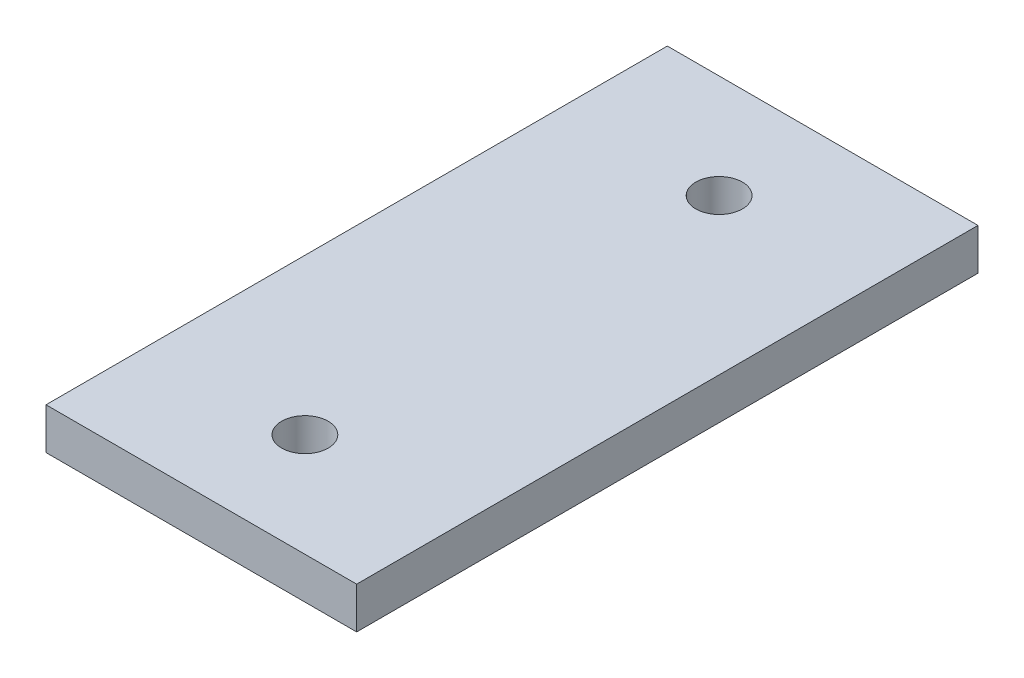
ISO-10303-21;
HEADER;
FILE_DESCRIPTION(('STEP AP214'),'2;1');
FILE_NAME('part.step','',(''),(''),'','','');
FILE_SCHEMA(('AUTOMOTIVE_DESIGN { 1 0 10303 214 1 1 1 1 }'));
ENDSEC;
DATA;
#1=APPLICATION_CONTEXT('core data for automotive mechanical design processes');
#2=APPLICATION_PROTOCOL_DEFINITION('international standard','automotive_design',2000,#1);
#3=PRODUCT_CONTEXT('',#1,'mechanical');
#4=PRODUCT('Part','Part','',(#3));
#5=PRODUCT_RELATED_PRODUCT_CATEGORY('part','',(#4));
#6=PRODUCT_DEFINITION_FORMATION('','',#4);
#7=PRODUCT_DEFINITION_CONTEXT('part definition',#1,'design');
#8=PRODUCT_DEFINITION('design','',#6,#7);
#9=PRODUCT_DEFINITION_SHAPE('','',#8);
#10=(LENGTH_UNIT() NAMED_UNIT(*) SI_UNIT(.MILLI.,.METRE.));
#11=(NAMED_UNIT(*) PLANE_ANGLE_UNIT() SI_UNIT($,.RADIAN.));
#12=(NAMED_UNIT(*) SI_UNIT($,.STERADIAN.) SOLID_ANGLE_UNIT());
#13=UNCERTAINTY_MEASURE_WITH_UNIT(LENGTH_MEASURE(1.E-05),#10,'distance_accuracy_value','');
#14=(GEOMETRIC_REPRESENTATION_CONTEXT(3) GLOBAL_UNCERTAINTY_ASSIGNED_CONTEXT((#13)) GLOBAL_UNIT_ASSIGNED_CONTEXT((#10,
#11,#12)) REPRESENTATION_CONTEXT('',''));
#15=CARTESIAN_POINT('',(0.,0.,0.));
#16=DIRECTION('',(0.,0.,1.));
#17=DIRECTION('',(1.,0.,0.));
#18=AXIS2_PLACEMENT_3D('',#15,#16,#17);
#19=CARTESIAN_POINT('',(0.,0.,120.));
#20=DIRECTION('',(1.,0.,0.));
#21=DIRECTION('',(0.,1.,0.));
#22=AXIS2_PLACEMENT_3D('',#19,#20,#21);
#23=PLANE('',#22);
#24=DIRECTION('',(0.,-1.,0.));
#25=VECTOR('',#24,1.);
#26=CARTESIAN_POINT('',(0.,0.,0.));
#27=LINE('',#26,#25);
#28=CARTESIAN_POINT('',(0.,0.,0.));
#29=VERTEX_POINT('',#28);
#30=CARTESIAN_POINT('',(0.,-8.,0.));
#31=VERTEX_POINT('',#30);
#32=EDGE_CURVE('E73',#29,#31,#27,.T.);
#33=ORIENTED_EDGE('',*,*,#32,.T.);
#34=DIRECTION('',(0.,0.,-1.));
#35=VECTOR('',#34,1.);
#36=CARTESIAN_POINT('',(0.,-8.,120.));
#37=LINE('',#36,#35);
#38=CARTESIAN_POINT('',(0.,-8.,120.));
#39=VERTEX_POINT('',#38);
#40=EDGE_CURVE('E11',#39,#31,#37,.T.);
#41=ORIENTED_EDGE('',*,*,#40,.F.);
#42=DIRECTION('',(0.,-1.,0.));
#43=VECTOR('',#42,1.);
#44=CARTESIAN_POINT('',(0.,0.,120.));
#45=LINE('',#44,#43);
#46=CARTESIAN_POINT('',(0.,0.,120.));
#47=VERTEX_POINT('',#46);
#48=EDGE_CURVE('E96',#47,#39,#45,.T.);
#49=ORIENTED_EDGE('',*,*,#48,.F.);
#50=DIRECTION('',(0.,0.,-1.));
#51=VECTOR('',#50,1.);
#52=CARTESIAN_POINT('',(0.,0.,120.));
#53=LINE('',#52,#51);
#54=EDGE_CURVE('E85',#47,#29,#53,.T.);
#55=ORIENTED_EDGE('',*,*,#54,.T.);
#56=EDGE_LOOP('',(#33,#41,#49,#55));
#57=FACE_BOUND('',#56,.T.);
#58=ADVANCED_FACE('F29',(#57),#23,.F.);
#59=CARTESIAN_POINT('',(0.,-8.,120.));
#60=DIRECTION('',(0.,1.,0.));
#61=DIRECTION('',(0.,0.,1.));
#62=AXIS2_PLACEMENT_3D('',#59,#60,#61);
#63=PLANE('',#62);
#64=CARTESIAN_POINT('',(30.,-8.,20.));
#65=DIRECTION('',(0.,1.,0.));
#66=DIRECTION('',(0.,0.,1.));
#67=AXIS2_PLACEMENT_3D('',#64,#65,#66);
#68=CIRCLE('',#67,4.5);
#69=CARTESIAN_POINT('',(30.,-8.,24.5));
#70=VERTEX_POINT('',#69);
#71=EDGE_CURVE('E131',#70,#70,#68,.T.);
#72=ORIENTED_EDGE('',*,*,#71,.T.);
#73=EDGE_LOOP('',(#72));
#74=FACE_BOUND('',#73,.T.);
#75=CARTESIAN_POINT('',(30.,-8.,100.));
#76=DIRECTION('',(0.,1.,0.));
#77=DIRECTION('',(0.,0.,1.));
#78=AXIS2_PLACEMENT_3D('',#75,#76,#77);
#79=CIRCLE('',#78,4.5);
#80=CARTESIAN_POINT('',(30.,-8.,104.5));
#81=VERTEX_POINT('',#80);
#82=EDGE_CURVE('E86',#81,#81,#79,.T.);
#83=ORIENTED_EDGE('',*,*,#82,.T.);
#84=EDGE_LOOP('',(#83));
#85=FACE_BOUND('',#84,.T.);
#86=DIRECTION('',(1.,0.,0.));
#87=VECTOR('',#86,1.);
#88=CARTESIAN_POINT('',(0.,-8.,0.));
#89=LINE('',#88,#87);
#90=CARTESIAN_POINT('',(60.,-8.,0.));
#91=VERTEX_POINT('',#90);
#92=EDGE_CURVE('E69',#31,#91,#89,.T.);
#93=ORIENTED_EDGE('',*,*,#92,.T.);
#94=DIRECTION('',(0.,0.,-1.));
#95=VECTOR('',#94,1.);
#96=CARTESIAN_POINT('',(60.,-8.,120.));
#97=LINE('',#96,#95);
#98=CARTESIAN_POINT('',(60.,-8.,120.));
#99=VERTEX_POINT('',#98);
#100=EDGE_CURVE('E36',#99,#91,#97,.T.);
#101=ORIENTED_EDGE('',*,*,#100,.F.);
#102=DIRECTION('',(1.,0.,0.));
#103=VECTOR('',#102,1.);
#104=CARTESIAN_POINT('',(0.,-8.,120.));
#105=LINE('',#104,#103);
#106=EDGE_CURVE('E81',#39,#99,#105,.T.);
#107=ORIENTED_EDGE('',*,*,#106,.F.);
#108=ORIENTED_EDGE('',*,*,#40,.T.);
#109=EDGE_LOOP('',(#93,#101,#107,#108));
#110=FACE_BOUND('',#109,.T.);
#111=ADVANCED_FACE('F80',(#74,#85,#110),#63,.F.);
#112=CARTESIAN_POINT('',(60.,0.,120.));
#113=DIRECTION('',(-1.,0.,0.));
#114=DIRECTION('',(0.,0.,1.));
#115=AXIS2_PLACEMENT_3D('',#112,#113,#114);
#116=PLANE('',#115);
#117=DIRECTION('',(0.,1.,0.));
#118=VECTOR('',#117,1.);
#119=CARTESIAN_POINT('',(60.,0.,0.));
#120=LINE('',#119,#118);
#121=CARTESIAN_POINT('',(60.,0.,0.));
#122=VERTEX_POINT('',#121);
#123=EDGE_CURVE('E74',#91,#122,#120,.T.);
#124=ORIENTED_EDGE('',*,*,#123,.T.);
#125=DIRECTION('',(0.,0.,-1.));
#126=VECTOR('',#125,1.);
#127=CARTESIAN_POINT('',(60.,0.,120.));
#128=LINE('',#127,#126);
#129=CARTESIAN_POINT('',(60.,0.,120.));
#130=VERTEX_POINT('',#129);
#131=EDGE_CURVE('E102',#130,#122,#128,.T.);
#132=ORIENTED_EDGE('',*,*,#131,.F.);
#133=DIRECTION('',(0.,1.,0.));
#134=VECTOR('',#133,1.);
#135=CARTESIAN_POINT('',(60.,0.,120.));
#136=LINE('',#135,#134);
#137=EDGE_CURVE('E48',#99,#130,#136,.T.);
#138=ORIENTED_EDGE('',*,*,#137,.F.);
#139=ORIENTED_EDGE('',*,*,#100,.T.);
#140=EDGE_LOOP('',(#124,#132,#138,#139));
#141=FACE_BOUND('',#140,.T.);
#142=ADVANCED_FACE('F105',(#141),#116,.F.);
#143=CARTESIAN_POINT('',(0.,0.,120.));
#144=DIRECTION('',(0.,-1.,0.));
#145=DIRECTION('',(0.,0.,-1.));
#146=AXIS2_PLACEMENT_3D('',#143,#144,#145);
#147=PLANE('',#146);
#148=CARTESIAN_POINT('',(30.,0.,20.));
#149=DIRECTION('',(0.,1.,0.));
#150=DIRECTION('',(0.,0.,1.));
#151=AXIS2_PLACEMENT_3D('',#148,#149,#150);
#152=CIRCLE('',#151,4.5);
#153=CARTESIAN_POINT('',(30.,0.,24.5));
#154=VERTEX_POINT('',#153);
#155=EDGE_CURVE('E146',#154,#154,#152,.T.);
#156=ORIENTED_EDGE('',*,*,#155,.F.);
#157=EDGE_LOOP('',(#156));
#158=FACE_BOUND('',#157,.T.);
#159=CARTESIAN_POINT('',(30.,0.,100.));
#160=DIRECTION('',(0.,1.,0.));
#161=DIRECTION('',(0.,0.,1.));
#162=AXIS2_PLACEMENT_3D('',#159,#160,#161);
#163=CIRCLE('',#162,4.5);
#164=CARTESIAN_POINT('',(30.,0.,104.5));
#165=VERTEX_POINT('',#164);
#166=EDGE_CURVE('E89',#165,#165,#163,.T.);
#167=ORIENTED_EDGE('',*,*,#166,.F.);
#168=EDGE_LOOP('',(#167));
#169=FACE_BOUND('',#168,.T.);
#170=DIRECTION('',(-1.,0.,0.));
#171=VECTOR('',#170,1.);
#172=CARTESIAN_POINT('',(0.,0.,0.));
#173=LINE('',#172,#171);
#174=EDGE_CURVE('E94',#122,#29,#173,.T.);
#175=ORIENTED_EDGE('',*,*,#174,.T.);
#176=ORIENTED_EDGE('',*,*,#54,.F.);
#177=DIRECTION('',(-1.,0.,0.));
#178=VECTOR('',#177,1.);
#179=CARTESIAN_POINT('',(0.,0.,120.));
#180=LINE('',#179,#178);
#181=EDGE_CURVE('E43',#130,#47,#180,.T.);
#182=ORIENTED_EDGE('',*,*,#181,.F.);
#183=ORIENTED_EDGE('',*,*,#131,.T.);
#184=EDGE_LOOP('',(#175,#176,#182,#183));
#185=FACE_BOUND('',#184,.T.);
#186=ADVANCED_FACE('F107',(#158,#169,#185),#147,.F.);
#187=CARTESIAN_POINT('',(0.,-8.,120.));
#188=DIRECTION('',(0.,0.,1.));
#189=DIRECTION('',(1.,0.,0.));
#190=AXIS2_PLACEMENT_3D('',#187,#188,#189);
#191=PLANE('',#190);
#192=ORIENTED_EDGE('',*,*,#48,.T.);
#193=ORIENTED_EDGE('',*,*,#106,.T.);
#194=ORIENTED_EDGE('',*,*,#137,.T.);
#195=ORIENTED_EDGE('',*,*,#181,.T.);
#196=EDGE_LOOP('',(#192,#193,#194,#195));
#197=FACE_BOUND('',#196,.T.);
#198=ADVANCED_FACE('F108',(#197),#191,.T.);
#199=CARTESIAN_POINT('',(0.,-8.,0.));
#200=DIRECTION('',(0.,0.,1.));
#201=DIRECTION('',(1.,0.,0.));
#202=AXIS2_PLACEMENT_3D('',#199,#200,#201);
#203=PLANE('',#202);
#204=ORIENTED_EDGE('',*,*,#32,.F.);
#205=ORIENTED_EDGE('',*,*,#174,.F.);
#206=ORIENTED_EDGE('',*,*,#123,.F.);
#207=ORIENTED_EDGE('',*,*,#92,.F.);
#208=EDGE_LOOP('',(#204,#205,#206,#207));
#209=FACE_BOUND('',#208,.T.);
#210=ADVANCED_FACE('F70',(#209),#203,.F.);
#211=CARTESIAN_POINT('',(30.,-10.,100.));
#212=DIRECTION('',(0.,1.,0.));
#213=DIRECTION('',(0.,0.,1.));
#214=AXIS2_PLACEMENT_3D('',#211,#212,#213);
#215=CYLINDRICAL_SURFACE('',#214,4.5);
#216=ORIENTED_EDGE('',*,*,#166,.T.);
#217=EDGE_LOOP('',(#216));
#218=FACE_BOUND('',#217,.T.);
#219=ORIENTED_EDGE('',*,*,#82,.F.);
#220=EDGE_LOOP('',(#219));
#221=FACE_BOUND('',#220,.T.);
#222=ADVANCED_FACE('F115',(#218,#221),#215,.F.);
#223=CARTESIAN_POINT('',(30.,-10.,20.));
#224=DIRECTION('',(0.,1.,0.));
#225=DIRECTION('',(0.,0.,1.));
#226=AXIS2_PLACEMENT_3D('',#223,#224,#225);
#227=CYLINDRICAL_SURFACE('',#226,4.5);
#228=ORIENTED_EDGE('',*,*,#155,.T.);
#229=EDGE_LOOP('',(#228));
#230=FACE_BOUND('',#229,.T.);
#231=ORIENTED_EDGE('',*,*,#71,.F.);
#232=EDGE_LOOP('',(#231));
#233=FACE_BOUND('',#232,.T.);
#234=ADVANCED_FACE('F135',(#230,#233),#227,.F.);
#235=CLOSED_SHELL('',(#58,#111,#142,#186,#198,#210,#222,#234));
#236=MANIFOLD_SOLID_BREP('B2',#235);
#237=ADVANCED_BREP_SHAPE_REPRESENTATION('',(#18,#236),#14);
#238=SHAPE_DEFINITION_REPRESENTATION(#9,#237);
ENDSEC;
END-ISO-10303-21;
